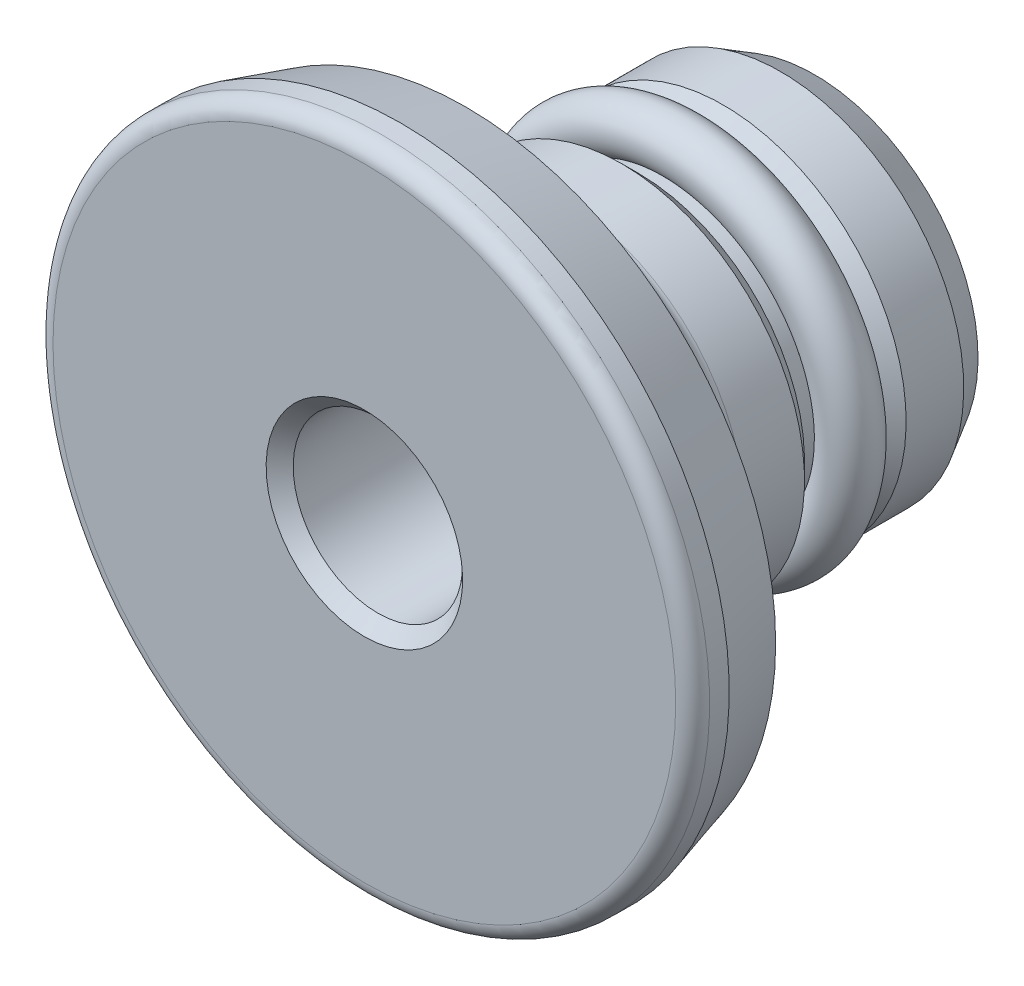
ISO-10303-21;
HEADER;
FILE_DESCRIPTION(('STEP AP214'),'2;1');
FILE_NAME('part.step','',(''),(''),'','','');
FILE_SCHEMA(('AUTOMOTIVE_DESIGN { 1 0 10303 214 1 1 1 1 }'));
ENDSEC;
DATA;
#1=APPLICATION_CONTEXT('core data for automotive mechanical design processes');
#2=APPLICATION_PROTOCOL_DEFINITION('international standard','automotive_design',2000,#1);
#3=PRODUCT_CONTEXT('',#1,'mechanical');
#4=PRODUCT('Part','Part','',(#3));
#5=PRODUCT_RELATED_PRODUCT_CATEGORY('part','',(#4));
#6=PRODUCT_DEFINITION_FORMATION('','',#4);
#7=PRODUCT_DEFINITION_CONTEXT('part definition',#1,'design');
#8=PRODUCT_DEFINITION('design','',#6,#7);
#9=PRODUCT_DEFINITION_SHAPE('','',#8);
#10=(LENGTH_UNIT() NAMED_UNIT(*) SI_UNIT(.MILLI.,.METRE.));
#11=(NAMED_UNIT(*) PLANE_ANGLE_UNIT() SI_UNIT($,.RADIAN.));
#12=(NAMED_UNIT(*) SI_UNIT($,.STERADIAN.) SOLID_ANGLE_UNIT());
#13=UNCERTAINTY_MEASURE_WITH_UNIT(LENGTH_MEASURE(1.E-05),#10,'distance_accuracy_value','');
#14=(GEOMETRIC_REPRESENTATION_CONTEXT(3) GLOBAL_UNCERTAINTY_ASSIGNED_CONTEXT((#13)) GLOBAL_UNIT_ASSIGNED_CONTEXT((#10,
#11,#12)) REPRESENTATION_CONTEXT('',''));
#15=CARTESIAN_POINT('',(0.,0.,0.));
#16=DIRECTION('',(0.,0.,1.));
#17=DIRECTION('',(1.,0.,0.));
#18=AXIS2_PLACEMENT_3D('',#15,#16,#17);
#19=CARTESIAN_POINT('',(0.,0.,0.61));
#20=DIRECTION('',(0.,0.,1.));
#21=DIRECTION('',(0.,-1.,0.));
#22=AXIS2_PLACEMENT_3D('',#19,#20,#21);
#23=CYLINDRICAL_SURFACE('',#22,5.4);
#24=CARTESIAN_POINT('',(0.,0.,-7.59));
#25=DIRECTION('',(0.,0.,-1.));
#26=DIRECTION('',(0.,1.,0.));
#27=AXIS2_PLACEMENT_3D('',#24,#25,#26);
#28=CIRCLE('',#27,5.4);
#29=CARTESIAN_POINT('',(0.,5.4,-7.59));
#30=VERTEX_POINT('',#29);
#31=EDGE_CURVE('E66',#30,#30,#28,.F.);
#32=ORIENTED_EDGE('',*,*,#31,.T.);
#33=EDGE_LOOP('',(#32));
#34=FACE_BOUND('',#33,.T.);
#35=CARTESIAN_POINT('',(0.,0.,-5.82661492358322));
#36=DIRECTION('',(0.,0.,1.));
#37=DIRECTION('',(0.,-1.,0.));
#38=AXIS2_PLACEMENT_3D('',#35,#36,#37);
#39=CIRCLE('',#38,5.4);
#40=CARTESIAN_POINT('',(0.,-5.4,-5.82661492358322));
#41=VERTEX_POINT('',#40);
#42=EDGE_CURVE('E51',#41,#41,#39,.F.);
#43=ORIENTED_EDGE('',*,*,#42,.T.);
#44=EDGE_LOOP('',(#43));
#45=FACE_BOUND('',#44,.T.);
#46=ADVANCED_FACE('F12',(#34,#45),#23,.T.);
#47=CARTESIAN_POINT('',(0.,0.,0.61));
#48=DIRECTION('',(0.,0.,1.));
#49=DIRECTION('',(0.,-1.,0.));
#50=AXIS2_PLACEMENT_3D('',#47,#48,#49);
#51=CYLINDRICAL_SURFACE('',#50,9.69);
#52=CARTESIAN_POINT('',(0.,0.,-0.5));
#53=DIRECTION('',(0.,0.,1.));
#54=DIRECTION('',(0.,-1.,0.));
#55=AXIS2_PLACEMENT_3D('',#52,#53,#54);
#56=CIRCLE('',#55,9.69);
#57=CARTESIAN_POINT('',(0.,-9.69,-0.5));
#58=VERTEX_POINT('',#57);
#59=EDGE_CURVE('E45',#58,#58,#56,.F.);
#60=ORIENTED_EDGE('',*,*,#59,.T.);
#61=EDGE_LOOP('',(#60));
#62=FACE_BOUND('',#61,.T.);
#63=CARTESIAN_POINT('',(0.,0.,-1.0779810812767));
#64=DIRECTION('',(0.,0.,1.));
#65=DIRECTION('',(0.,-1.,0.));
#66=AXIS2_PLACEMENT_3D('',#63,#64,#65);
#67=CIRCLE('',#66,9.69);
#68=CARTESIAN_POINT('',(0.,-9.69,-1.0779810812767));
#69=VERTEX_POINT('',#68);
#70=EDGE_CURVE('E39',#69,#69,#67,.T.);
#71=ORIENTED_EDGE('',*,*,#70,.T.);
#72=EDGE_LOOP('',(#71));
#73=FACE_BOUND('',#72,.T.);
#74=ADVANCED_FACE('F103',(#62,#73),#51,.T.);
#75=CARTESIAN_POINT('',(0.,0.,-3.00050447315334));
#76=DIRECTION('',(0.,0.,1.));
#77=DIRECTION('',(0.,-1.,0.));
#78=AXIS2_PLACEMENT_3D('',#75,#76,#77);
#79=CONICAL_SURFACE('',#78,9.13872528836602,0.279252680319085);
#80=ORIENTED_EDGE('',*,*,#70,.F.);
#81=EDGE_LOOP('',(#80));
#82=FACE_BOUND('',#81,.T.);
#83=CARTESIAN_POINT('',(0.,0.,-3.00050447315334));
#84=DIRECTION('',(0.,0.,1.));
#85=DIRECTION('',(0.,-1.,0.));
#86=AXIS2_PLACEMENT_3D('',#83,#84,#85);
#87=CIRCLE('',#86,9.13872528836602);
#88=CARTESIAN_POINT('',(0.,-9.13872528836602,-3.00050447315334));
#89=VERTEX_POINT('',#88);
#90=EDGE_CURVE('E36',#89,#89,#87,.T.);
#91=ORIENTED_EDGE('',*,*,#90,.T.);
#92=EDGE_LOOP('',(#91));
#93=FACE_BOUND('',#92,.T.);
#94=ADVANCED_FACE('F111',(#82,#93),#79,.T.);
#95=CARTESIAN_POINT('',(0.,0.,-5.61838810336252));
#96=DIRECTION('',(0.,0.,1.));
#97=DIRECTION('',(0.,-1.,0.));
#98=AXIS2_PLACEMENT_3D('',#95,#96,#97);
#99=CONICAL_SURFACE('',#98,5.4,0.959931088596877);
#100=CARTESIAN_POINT('',(0.,0.,-5.49895410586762));
#101=DIRECTION('',(0.,0.,1.));
#102=DIRECTION('',(0.,-1.,0.));
#103=AXIS2_PLACEMENT_3D('',#100,#101,#102);
#104=CIRCLE('',#103,5.57056942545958);
#105=CARTESIAN_POINT('',(0.,-5.57056942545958,-5.49895410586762));
#106=VERTEX_POINT('',#105);
#107=EDGE_CURVE('E48',#106,#106,#104,.T.);
#108=ORIENTED_EDGE('',*,*,#107,.T.);
#109=EDGE_LOOP('',(#108));
#110=FACE_BOUND('',#109,.T.);
#111=ORIENTED_EDGE('',*,*,#90,.F.);
#112=EDGE_LOOP('',(#111));
#113=FACE_BOUND('',#112,.T.);
#114=ADVANCED_FACE('F160',(#110,#113),#99,.T.);
#115=CARTESIAN_POINT('',(9.69,0.,0.));
#116=DIRECTION('',(0.,0.,1.));
#117=DIRECTION('',(0.,-1.,0.));
#118=AXIS2_PLACEMENT_3D('',#115,#116,#117);
#119=PLANE('',#118);
#120=CARTESIAN_POINT('',(0.,0.,0.));
#121=DIRECTION('',(0.,0.,1.));
#122=DIRECTION('',(0.,-1.,0.));
#123=AXIS2_PLACEMENT_3D('',#120,#121,#122);
#124=CIRCLE('',#123,2.9);
#125=CARTESIAN_POINT('',(0.,-2.9,0.));
#126=VERTEX_POINT('',#125);
#127=EDGE_CURVE('E33',#126,#126,#124,.T.);
#128=ORIENTED_EDGE('',*,*,#127,.F.);
#129=EDGE_LOOP('',(#128));
#130=FACE_BOUND('',#129,.T.);
#131=CARTESIAN_POINT('',(0.,0.,0.));
#132=DIRECTION('',(0.,0.,1.));
#133=DIRECTION('',(0.,-1.,0.));
#134=AXIS2_PLACEMENT_3D('',#131,#132,#133);
#135=CIRCLE('',#134,9.19);
#136=CARTESIAN_POINT('',(0.,-9.19,0.));
#137=VERTEX_POINT('',#136);
#138=EDGE_CURVE('E42',#137,#137,#135,.T.);
#139=ORIENTED_EDGE('',*,*,#138,.T.);
#140=EDGE_LOOP('',(#139));
#141=FACE_BOUND('',#140,.T.);
#142=ADVANCED_FACE('F156',(#130,#141),#119,.T.);
#143=CARTESIAN_POINT('',(0.,0.,-0.5));
#144=DIRECTION('',(0.,0.,1.));
#145=DIRECTION('',(0.,-1.,0.));
#146=AXIS2_PLACEMENT_3D('',#143,#144,#145);
#147=TOROIDAL_SURFACE('',#146,9.19,0.5);
#148=ORIENTED_EDGE('',*,*,#59,.F.);
#149=EDGE_LOOP('',(#148));
#150=FACE_BOUND('',#149,.T.);
#151=ORIENTED_EDGE('',*,*,#138,.F.);
#152=EDGE_LOOP('',(#151));
#153=FACE_BOUND('',#152,.T.);
#154=ADVANCED_FACE('F159',(#150,#153),#147,.T.);
#155=CARTESIAN_POINT('',(0.,0.,-5.82661492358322));
#156=DIRECTION('',(0.,0.,1.));
#157=DIRECTION('',(0.,-1.,0.));
#158=AXIS2_PLACEMENT_3D('',#155,#156,#157);
#159=TOROIDAL_SURFACE('',#158,5.8,0.4);
#160=ORIENTED_EDGE('',*,*,#42,.F.);
#161=EDGE_LOOP('',(#160));
#162=FACE_BOUND('',#161,.T.);
#163=ORIENTED_EDGE('',*,*,#107,.F.);
#164=EDGE_LOOP('',(#163));
#165=FACE_BOUND('',#164,.T.);
#166=ADVANCED_FACE('F166',(#162,#165),#159,.F.);
#167=CARTESIAN_POINT('',(5.4,0.,-8.09));
#168=DIRECTION('',(0.,0.,-1.));
#169=DIRECTION('',(0.,1.,0.));
#170=AXIS2_PLACEMENT_3D('',#167,#168,#169);
#171=PLANE('',#170);
#172=CARTESIAN_POINT('',(0.,0.,-8.09));
#173=DIRECTION('',(0.,0.,-1.));
#174=DIRECTION('',(0.,1.,0.));
#175=AXIS2_PLACEMENT_3D('',#172,#173,#174);
#176=CIRCLE('',#175,4.9);
#177=CARTESIAN_POINT('',(0.,4.9,-8.09));
#178=VERTEX_POINT('',#177);
#179=EDGE_CURVE('E69',#178,#178,#176,.T.);
#180=ORIENTED_EDGE('',*,*,#179,.T.);
#181=EDGE_LOOP('',(#180));
#182=FACE_BOUND('',#181,.T.);
#183=CARTESIAN_POINT('',(0.,0.,-8.09));
#184=DIRECTION('',(0.,0.,-1.));
#185=DIRECTION('',(0.,1.,0.));
#186=AXIS2_PLACEMENT_3D('',#183,#184,#185);
#187=CIRCLE('',#186,4.65);
#188=CARTESIAN_POINT('',(0.,4.65,-8.09));
#189=VERTEX_POINT('',#188);
#190=EDGE_CURVE('E63',#189,#189,#187,.F.);
#191=ORIENTED_EDGE('',*,*,#190,.T.);
#192=EDGE_LOOP('',(#191));
#193=FACE_BOUND('',#192,.T.);
#194=ADVANCED_FACE('F162',(#182,#193),#171,.T.);
#195=CARTESIAN_POINT('',(0.,0.,0.61));
#196=DIRECTION('',(0.,0.,1.));
#197=DIRECTION('',(0.,-1.,0.));
#198=AXIS2_PLACEMENT_3D('',#195,#196,#197);
#199=CYLINDRICAL_SURFACE('',#198,4.25);
#200=CARTESIAN_POINT('',(0.,0.,-9.30519476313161));
#201=DIRECTION('',(0.,0.,1.));
#202=DIRECTION('',(0.,-1.,0.));
#203=AXIS2_PLACEMENT_3D('',#200,#201,#202);
#204=CIRCLE('',#203,4.25);
#205=CARTESIAN_POINT('',(0.,-4.25,-9.30519476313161));
#206=VERTEX_POINT('',#205);
#207=EDGE_CURVE('E16',#206,#206,#204,.F.);
#208=ORIENTED_EDGE('',*,*,#207,.F.);
#209=EDGE_LOOP('',(#208));
#210=FACE_BOUND('',#209,.T.);
#211=CARTESIAN_POINT('',(0.,0.,-8.49));
#212=DIRECTION('',(0.,0.,-1.));
#213=DIRECTION('',(0.,1.,0.));
#214=AXIS2_PLACEMENT_3D('',#211,#212,#213);
#215=CIRCLE('',#214,4.25);
#216=CARTESIAN_POINT('',(0.,4.25,-8.49));
#217=VERTEX_POINT('',#216);
#218=EDGE_CURVE('E60',#217,#217,#215,.T.);
#219=ORIENTED_EDGE('',*,*,#218,.T.);
#220=EDGE_LOOP('',(#219));
#221=FACE_BOUND('',#220,.T.);
#222=ADVANCED_FACE('F165',(#210,#221),#199,.T.);
#223=CARTESIAN_POINT('',(0.,0.,0.));
#224=DIRECTION('',(0.,0.,1.));
#225=DIRECTION('',(0.,-1.,0.));
#226=AXIS2_PLACEMENT_3D('',#223,#224,#225);
#227=CONICAL_SURFACE('',#226,2.9,0.785398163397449);
#228=CARTESIAN_POINT('',(0.,0.,-0.4));
#229=DIRECTION('',(0.,0.,1.));
#230=DIRECTION('',(0.,-1.,0.));
#231=AXIS2_PLACEMENT_3D('',#228,#229,#230);
#232=CIRCLE('',#231,2.5);
#233=CARTESIAN_POINT('',(0.,-2.5,-0.4));
#234=VERTEX_POINT('',#233);
#235=EDGE_CURVE('E32',#234,#234,#232,.F.);
#236=ORIENTED_EDGE('',*,*,#235,.T.);
#237=EDGE_LOOP('',(#236));
#238=FACE_BOUND('',#237,.T.);
#239=ORIENTED_EDGE('',*,*,#127,.T.);
#240=EDGE_LOOP('',(#239));
#241=FACE_BOUND('',#240,.T.);
#242=ADVANCED_FACE('F79',(#238,#241),#227,.F.);
#243=CARTESIAN_POINT('',(0.,0.,-8.49));
#244=DIRECTION('',(0.,0.,-1.));
#245=DIRECTION('',(0.,1.,0.));
#246=AXIS2_PLACEMENT_3D('',#243,#244,#245);
#247=TOROIDAL_SURFACE('',#246,4.65,0.4);
#248=ORIENTED_EDGE('',*,*,#218,.F.);
#249=EDGE_LOOP('',(#248));
#250=FACE_BOUND('',#249,.T.);
#251=ORIENTED_EDGE('',*,*,#190,.F.);
#252=EDGE_LOOP('',(#251));
#253=FACE_BOUND('',#252,.T.);
#254=ADVANCED_FACE('F171',(#250,#253),#247,.F.);
#255=CARTESIAN_POINT('',(0.,0.,-7.59));
#256=DIRECTION('',(0.,0.,1.));
#257=DIRECTION('',(0.,-1.,0.));
#258=AXIS2_PLACEMENT_3D('',#255,#256,#257);
#259=CONICAL_SURFACE('',#258,5.4,0.785398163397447);
#260=ORIENTED_EDGE('',*,*,#179,.F.);
#261=EDGE_LOOP('',(#260));
#262=FACE_BOUND('',#261,.T.);
#263=ORIENTED_EDGE('',*,*,#31,.F.);
#264=EDGE_LOOP('',(#263));
#265=FACE_BOUND('',#264,.T.);
#266=ADVANCED_FACE('F97',(#262,#265),#259,.T.);
#267=CARTESIAN_POINT('',(0.,0.,-5.));
#268=DIRECTION('',(0.,0.,1.));
#269=DIRECTION('',(0.,-1.,0.));
#270=AXIS2_PLACEMENT_3D('',#267,#268,#269);
#271=PLANE('',#270);
#272=CARTESIAN_POINT('',(0.,0.,-5.));
#273=DIRECTION('',(0.,0.,1.));
#274=DIRECTION('',(0.,-1.,0.));
#275=AXIS2_PLACEMENT_3D('',#272,#273,#274);
#276=CIRCLE('',#275,2.5);
#277=CARTESIAN_POINT('',(0.,-2.5,-5.));
#278=VERTEX_POINT('',#277);
#279=EDGE_CURVE('E29',#278,#278,#276,.T.);
#280=ORIENTED_EDGE('',*,*,#279,.T.);
#281=EDGE_LOOP('',(#280));
#282=FACE_BOUND('',#281,.T.);
#283=ADVANCED_FACE('F85',(#282),#271,.T.);
#284=CARTESIAN_POINT('',(0.,0.,-5.));
#285=DIRECTION('',(0.,0.,1.));
#286=DIRECTION('',(0.,-1.,0.));
#287=AXIS2_PLACEMENT_3D('',#284,#285,#286);
#288=CYLINDRICAL_SURFACE('',#287,2.5);
#289=ORIENTED_EDGE('',*,*,#279,.F.);
#290=EDGE_LOOP('',(#289));
#291=FACE_BOUND('',#290,.T.);
#292=ORIENTED_EDGE('',*,*,#235,.F.);
#293=EDGE_LOOP('',(#292));
#294=FACE_BOUND('',#293,.T.);
#295=ADVANCED_FACE('F82',(#291,#294),#288,.F.);
#296=CARTESIAN_POINT('',(0.,-4.9,-9.30519476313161));
#297=DIRECTION('',(0.,0.,1.));
#298=DIRECTION('',(0.,-1.,0.));
#299=AXIS2_PLACEMENT_3D('',#296,#297,#298);
#300=PLANE('',#299);
#301=CARTESIAN_POINT('',(0.,0.,-9.30519476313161));
#302=DIRECTION('',(0.,0.,-1.));
#303=DIRECTION('',(0.,1.,0.));
#304=AXIS2_PLACEMENT_3D('',#301,#302,#303);
#305=CIRCLE('',#304,4.2508080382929);
#306=CARTESIAN_POINT('',(0.,4.2508080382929,-9.30519476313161));
#307=VERTEX_POINT('',#306);
#308=EDGE_CURVE('E8',#307,#307,#305,.T.);
#309=ORIENTED_EDGE('',*,*,#308,.F.);
#310=EDGE_LOOP('',(#309));
#311=FACE_BOUND('',#310,.T.);
#312=ORIENTED_EDGE('',*,*,#207,.T.);
#313=EDGE_LOOP('',(#312));
#314=FACE_BOUND('',#313,.T.);
#315=ADVANCED_FACE('F84',(#311,#314),#300,.T.);
#316=CARTESIAN_POINT('',(0.,0.,-9.34));
#317=DIRECTION('',(0.,0.,-1.));
#318=DIRECTION('',(-1.,0.,0.));
#319=AXIS2_PLACEMENT_3D('',#316,#317,#318);
#320=TOROIDAL_SURFACE('',#319,5.,0.75);
#321=ORIENTED_EDGE('',*,*,#308,.T.);
#322=EDGE_LOOP('',(#321));
#323=FACE_BOUND('',#322,.T.);
#324=CARTESIAN_POINT('',(0.,0.,-10.09));
#325=DIRECTION('',(0.,0.,1.));
#326=DIRECTION('',(0.,-1.,0.));
#327=AXIS2_PLACEMENT_3D('',#324,#325,#326);
#328=CIRCLE('',#327,5.00021400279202);
#329=CARTESIAN_POINT('',(0.,-5.00021400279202,-10.09));
#330=VERTEX_POINT('',#329);
#331=EDGE_CURVE('E26',#330,#330,#328,.T.);
#332=ORIENTED_EDGE('',*,*,#331,.T.);
#333=EDGE_LOOP('',(#332));
#334=FACE_BOUND('',#333,.T.);
#335=ADVANCED_FACE('F94',(#323,#334),#320,.T.);
#336=CARTESIAN_POINT('',(5.4,0.,-13.29));
#337=DIRECTION('',(0.,0.,1.));
#338=DIRECTION('',(0.,-1.,0.));
#339=AXIS2_PLACEMENT_3D('',#336,#337,#338);
#340=PLANE('',#339);
#341=CARTESIAN_POINT('',(0.,0.,-13.29));
#342=DIRECTION('',(0.,0.,1.));
#343=DIRECTION('',(0.,-1.,0.));
#344=AXIS2_PLACEMENT_3D('',#341,#342,#343);
#345=CIRCLE('',#344,4.82264973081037);
#346=CARTESIAN_POINT('',(0.,-4.82264973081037,-13.29));
#347=VERTEX_POINT('',#346);
#348=EDGE_CURVE('E57',#347,#347,#345,.F.);
#349=ORIENTED_EDGE('',*,*,#348,.T.);
#350=EDGE_LOOP('',(#349));
#351=FACE_BOUND('',#350,.T.);
#352=ADVANCED_FACE('F127',(#351),#340,.F.);
#353=CARTESIAN_POINT('',(0.,0.,-12.29));
#354=DIRECTION('',(0.,0.,1.));
#355=DIRECTION('',(0.,-1.,0.));
#356=AXIS2_PLACEMENT_3D('',#353,#354,#355);
#357=CONICAL_SURFACE('',#356,5.4,0.523598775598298);
#358=ORIENTED_EDGE('',*,*,#348,.F.);
#359=EDGE_LOOP('',(#358));
#360=FACE_BOUND('',#359,.T.);
#361=CARTESIAN_POINT('',(0.,0.,-12.29));
#362=DIRECTION('',(0.,0.,1.));
#363=DIRECTION('',(0.,-1.,0.));
#364=AXIS2_PLACEMENT_3D('',#361,#362,#363);
#365=CIRCLE('',#364,5.4);
#366=CARTESIAN_POINT('',(0.,-5.4,-12.29));
#367=VERTEX_POINT('',#366);
#368=EDGE_CURVE('E54',#367,#367,#365,.T.);
#369=ORIENTED_EDGE('',*,*,#368,.F.);
#370=EDGE_LOOP('',(#369));
#371=FACE_BOUND('',#370,.T.);
#372=ADVANCED_FACE('F118',(#360,#371),#357,.T.);
#373=CARTESIAN_POINT('',(0.,0.,-10.59));
#374=DIRECTION('',(0.,0.,1.));
#375=DIRECTION('',(0.,-1.,0.));
#376=AXIS2_PLACEMENT_3D('',#373,#374,#375);
#377=CIRCLE('',#376,5.4);
#378=CARTESIAN_POINT('',(0.,-5.4,-10.59));
#379=VERTEX_POINT('',#378);
#380=EDGE_CURVE('E24',#379,#379,#377,.F.);
#381=ORIENTED_EDGE('',*,*,#380,.T.);
#382=EDGE_LOOP('',(#381));
#383=FACE_BOUND('',#382,.T.);
#384=ORIENTED_EDGE('',*,*,#368,.T.);
#385=EDGE_LOOP('',(#384));
#386=FACE_BOUND('',#385,.T.);
#387=ADVANCED_FACE('F106',(#383,#386),#23,.T.);
#388=CARTESIAN_POINT('',(0.,0.,-10.09));
#389=DIRECTION('',(0.,0.,-1.));
#390=DIRECTION('',(0.,1.,0.));
#391=AXIS2_PLACEMENT_3D('',#388,#389,#390);
#392=CONICAL_SURFACE('',#391,4.9,0.785398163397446);
#393=ORIENTED_EDGE('',*,*,#380,.F.);
#394=EDGE_LOOP('',(#393));
#395=FACE_BOUND('',#394,.T.);
#396=CARTESIAN_POINT('',(0.,0.,-10.09));
#397=DIRECTION('',(0.,0.,1.));
#398=DIRECTION('',(0.,-1.,0.));
#399=AXIS2_PLACEMENT_3D('',#396,#397,#398);
#400=CIRCLE('',#399,4.9);
#401=CARTESIAN_POINT('',(0.,-4.9,-10.09));
#402=VERTEX_POINT('',#401);
#403=EDGE_CURVE('E72',#402,#402,#400,.T.);
#404=ORIENTED_EDGE('',*,*,#403,.F.);
#405=EDGE_LOOP('',(#404));
#406=FACE_BOUND('',#405,.T.);
#407=ADVANCED_FACE('F14',(#395,#406),#392,.T.);
#408=CARTESIAN_POINT('',(0.,-4.9,-10.09));
#409=DIRECTION('',(0.,0.,-1.));
#410=DIRECTION('',(0.,1.,0.));
#411=AXIS2_PLACEMENT_3D('',#408,#409,#410);
#412=PLANE('',#411);
#413=ORIENTED_EDGE('',*,*,#331,.F.);
#414=EDGE_LOOP('',(#413));
#415=FACE_BOUND('',#414,.T.);
#416=ORIENTED_EDGE('',*,*,#403,.T.);
#417=EDGE_LOOP('',(#416));
#418=FACE_BOUND('',#417,.T.);
#419=ADVANCED_FACE('F125',(#415,#418),#412,.T.);
#420=CLOSED_SHELL('',(#46,#74,#94,#114,#142,#154,#166,#194,#222,#242,#254,#266,#283,#295,#315,
#335,#352,#372,#387,#407,#419));
#421=MANIFOLD_SOLID_BREP('B1',#420);
#422=ADVANCED_BREP_SHAPE_REPRESENTATION('',(#18,#421),#14);
#423=SHAPE_DEFINITION_REPRESENTATION(#9,#422);
ENDSEC;
END-ISO-10303-21;
